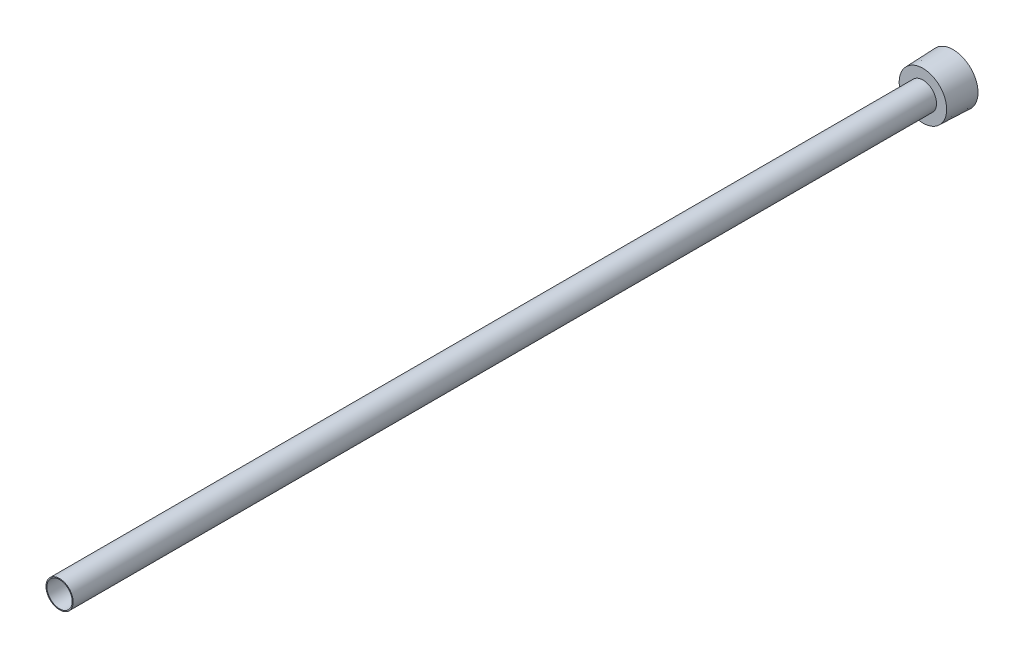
ISO-10303-21;
HEADER;
FILE_DESCRIPTION(('STEP AP214'),'2;1');
FILE_NAME('part.step','',(''),(''),'','','');
FILE_SCHEMA(('AUTOMOTIVE_DESIGN { 1 0 10303 214 1 1 1 1 }'));
ENDSEC;
DATA;
#1=APPLICATION_CONTEXT('core data for automotive mechanical design processes');
#2=APPLICATION_PROTOCOL_DEFINITION('international standard','automotive_design',2000,#1);
#3=PRODUCT_CONTEXT('',#1,'mechanical');
#4=PRODUCT('Part','Part','',(#3));
#5=PRODUCT_RELATED_PRODUCT_CATEGORY('part','',(#4));
#6=PRODUCT_DEFINITION_FORMATION('','',#4);
#7=PRODUCT_DEFINITION_CONTEXT('part definition',#1,'design');
#8=PRODUCT_DEFINITION('design','',#6,#7);
#9=PRODUCT_DEFINITION_SHAPE('','',#8);
#10=(LENGTH_UNIT() NAMED_UNIT(*) SI_UNIT(.MILLI.,.METRE.));
#11=(NAMED_UNIT(*) PLANE_ANGLE_UNIT() SI_UNIT($,.RADIAN.));
#12=(NAMED_UNIT(*) SI_UNIT($,.STERADIAN.) SOLID_ANGLE_UNIT());
#13=UNCERTAINTY_MEASURE_WITH_UNIT(LENGTH_MEASURE(1.E-05),#10,'distance_accuracy_value','');
#14=(GEOMETRIC_REPRESENTATION_CONTEXT(3) GLOBAL_UNCERTAINTY_ASSIGNED_CONTEXT((#13)) GLOBAL_UNIT_ASSIGNED_CONTEXT((#10,
#11,#12)) REPRESENTATION_CONTEXT('',''));
#15=CARTESIAN_POINT('',(0.,0.,0.));
#16=DIRECTION('',(0.,0.,1.));
#17=DIRECTION('',(1.,0.,0.));
#18=AXIS2_PLACEMENT_3D('',#15,#16,#17);
#19=CARTESIAN_POINT('',(0.,0.,0.));
#20=DIRECTION('',(0.,0.,1.));
#21=DIRECTION('',(1.,0.,0.));
#22=AXIS2_PLACEMENT_3D('',#19,#20,#21);
#23=CYLINDRICAL_SURFACE('',#22,4.318);
#24=CARTESIAN_POINT('',(0.,0.,304.8));
#25=DIRECTION('',(0.,0.,1.));
#26=DIRECTION('',(1.,0.,0.));
#27=AXIS2_PLACEMENT_3D('',#24,#25,#26);
#28=CIRCLE('',#27,4.318);
#29=CARTESIAN_POINT('',(4.318,0.,304.8));
#30=VERTEX_POINT('',#29);
#31=EDGE_CURVE('E142',#30,#30,#28,.T.);
#32=CARTESIAN_POINT('',(0.,0.,6.35));
#33=DIRECTION('',(0.,0.,-1.));
#34=DIRECTION('',(-1.,0.,0.));
#35=AXIS2_PLACEMENT_3D('',#32,#33,#34);
#36=CIRCLE('',#35,4.318);
#37=CARTESIAN_POINT('',(4.318,0.,6.35));
#38=VERTEX_POINT('',#37);
#39=EDGE_CURVE('E37',#38,#38,#36,.F.);
#40=CARTESIAN_POINT('',(4.318,0.,304.8));
#41=CARTESIAN_POINT('',(4.318,0.,301.691145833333));
#42=CARTESIAN_POINT('',(4.318,0.,298.582291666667));
#43=CARTESIAN_POINT('',(4.318,0.,292.364583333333));
#44=CARTESIAN_POINT('',(4.318,0.,289.255729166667));
#45=CARTESIAN_POINT('',(4.318,0.,283.038020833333));
#46=CARTESIAN_POINT('',(4.318,0.,279.929166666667));
#47=CARTESIAN_POINT('',(4.318,0.,273.711458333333));
#48=CARTESIAN_POINT('',(4.318,0.,270.602604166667));
#49=CARTESIAN_POINT('',(4.318,0.,264.384895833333));
#50=CARTESIAN_POINT('',(4.318,0.,261.276041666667));
#51=CARTESIAN_POINT('',(4.318,0.,255.058333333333));
#52=CARTESIAN_POINT('',(4.318,0.,251.949479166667));
#53=CARTESIAN_POINT('',(4.318,0.,245.731770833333));
#54=CARTESIAN_POINT('',(4.318,0.,242.622916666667));
#55=CARTESIAN_POINT('',(4.318,0.,236.405208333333));
#56=CARTESIAN_POINT('',(4.318,0.,233.296354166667));
#57=CARTESIAN_POINT('',(4.318,0.,227.078645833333));
#58=CARTESIAN_POINT('',(4.318,0.,223.969791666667));
#59=CARTESIAN_POINT('',(4.318,0.,217.752083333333));
#60=CARTESIAN_POINT('',(4.318,0.,214.643229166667));
#61=CARTESIAN_POINT('',(4.318,0.,208.425520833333));
#62=CARTESIAN_POINT('',(4.318,0.,205.316666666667));
#63=CARTESIAN_POINT('',(4.318,0.,199.098958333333));
#64=CARTESIAN_POINT('',(4.318,0.,195.990104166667));
#65=CARTESIAN_POINT('',(4.318,0.,189.772395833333));
#66=CARTESIAN_POINT('',(4.318,0.,186.663541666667));
#67=CARTESIAN_POINT('',(4.318,0.,180.445833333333));
#68=CARTESIAN_POINT('',(4.318,0.,177.336979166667));
#69=CARTESIAN_POINT('',(4.318,0.,171.119270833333));
#70=CARTESIAN_POINT('',(4.318,0.,168.010416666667));
#71=CARTESIAN_POINT('',(4.318,0.,161.792708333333));
#72=CARTESIAN_POINT('',(4.318,0.,158.683854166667));
#73=CARTESIAN_POINT('',(4.318,0.,152.466145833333));
#74=CARTESIAN_POINT('',(4.318,0.,149.357291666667));
#75=CARTESIAN_POINT('',(4.318,0.,143.139583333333));
#76=CARTESIAN_POINT('',(4.318,0.,140.030729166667));
#77=CARTESIAN_POINT('',(4.318,0.,133.813020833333));
#78=CARTESIAN_POINT('',(4.318,0.,130.704166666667));
#79=CARTESIAN_POINT('',(4.318,0.,124.486458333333));
#80=CARTESIAN_POINT('',(4.318,0.,121.377604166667));
#81=CARTESIAN_POINT('',(4.318,0.,115.159895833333));
#82=CARTESIAN_POINT('',(4.318,0.,112.051041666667));
#83=CARTESIAN_POINT('',(4.318,0.,105.833333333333));
#84=CARTESIAN_POINT('',(4.318,0.,102.724479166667));
#85=CARTESIAN_POINT('',(4.318,0.,96.5067708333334));
#86=CARTESIAN_POINT('',(4.318,0.,93.3979166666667));
#87=CARTESIAN_POINT('',(4.318,0.,87.1802083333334));
#88=CARTESIAN_POINT('',(4.318,0.,84.0713541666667));
#89=CARTESIAN_POINT('',(4.318,0.,77.8536458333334));
#90=CARTESIAN_POINT('',(4.318,0.,74.7447916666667));
#91=CARTESIAN_POINT('',(4.318,0.,68.5270833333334));
#92=CARTESIAN_POINT('',(4.318,0.,65.4182291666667));
#93=CARTESIAN_POINT('',(4.318,0.,59.2005208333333));
#94=CARTESIAN_POINT('',(4.318,0.,56.0916666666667));
#95=CARTESIAN_POINT('',(4.318,0.,49.8739583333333));
#96=CARTESIAN_POINT('',(4.318,0.,46.7651041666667));
#97=CARTESIAN_POINT('',(4.318,0.,40.5473958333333));
#98=CARTESIAN_POINT('',(4.318,0.,37.4385416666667));
#99=CARTESIAN_POINT('',(4.318,0.,31.2208333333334));
#100=CARTESIAN_POINT('',(4.318,0.,28.1119791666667));
#101=CARTESIAN_POINT('',(4.318,0.,21.8942708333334));
#102=CARTESIAN_POINT('',(4.318,0.,18.7854166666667));
#103=CARTESIAN_POINT('',(4.318,0.,12.5677083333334));
#104=CARTESIAN_POINT('',(4.318,0.,9.45885416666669));
#105=CARTESIAN_POINT('',(4.318,0.,6.35000000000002));
#106=B_SPLINE_CURVE_WITH_KNOTS('',3,(#40,#41,#42,#43,#44,#45,#46,#47,#48,#49,#50,#51,#52,#53,
#54,#55,#56,#57,#58,#59,#60,#61,#62,#63,#64,#65,#66,#67,#68,#69,#70,#71,#72,#73,#74,#75,#76,#77,
#78,#79,#80,#81,#82,#83,#84,#85,#86,#87,#88,#89,#90,#91,#92,#93,#94,#95,#96,#97,#98,#99,#100,
#101,#102,#103,#104,#105),.UNSPECIFIED.,.F.,.F.,(4,2,2,2,2,2,2,2,2,2,2,2,2,2,2,2,2,2,2,2,2,2,2,
2,2,2,2,2,2,2,2,2,4),(0.,9.32656250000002,18.653125,27.9796875,37.30625,46.6328125,55.959375,
65.2859375,74.6125,83.9390625,93.265625,102.5921875,111.91875,121.2453125,130.571875,
139.8984375,149.225,158.5515625,167.878125,177.2046875,186.53125,195.8578125,205.184375,
214.5109375,223.8375,233.1640625,242.490625,251.8171875,261.14375,270.4703125,279.796875,
289.1234375,298.45),.UNSPECIFIED.);
#107=EDGE_CURVE('BSEAM33',#30,#38,#106,.T.);
#108=ORIENTED_EDGE('',*,*,#31,.T.);
#109=ORIENTED_EDGE('',*,*,#39,.F.);
#110=ORIENTED_EDGE('',*,*,#107,.T.);
#111=ORIENTED_EDGE('',*,*,#107,.F.);
#112=EDGE_LOOP('',(#108,#110,#109,#111));
#113=FACE_BOUND('',#112,.T.);
#114=ADVANCED_FACE('F33',(#113),#23,.F.);
#115=CARTESIAN_POINT('',(0.,0.,0.));
#116=DIRECTION('',(0.,0.,-1.));
#117=DIRECTION('',(-1.,0.,0.));
#118=AXIS2_PLACEMENT_3D('',#115,#116,#117);
#119=CONICAL_SURFACE('',#118,8.4709,0.0364599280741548);
#120=CARTESIAN_POINT('',(0.,0.,10.3124));
#121=DIRECTION('',(0.,0.,1.));
#122=DIRECTION('',(1.,0.,0.));
#123=AXIS2_PLACEMENT_3D('',#120,#121,#122);
#124=CIRCLE('',#123,8.09474394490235);
#125=CARTESIAN_POINT('',(8.09474394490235,0.,10.3124));
#126=VERTEX_POINT('',#125);
#127=EDGE_CURVE('E11',#126,#126,#124,.T.);
#128=ORIENTED_EDGE('',*,*,#127,.F.);
#129=EDGE_LOOP('',(#128));
#130=FACE_BOUND('',#129,.T.);
#131=CARTESIAN_POINT('',(0.,0.,0.));
#132=DIRECTION('',(0.,0.,1.));
#133=DIRECTION('',(1.,0.,0.));
#134=AXIS2_PLACEMENT_3D('',#131,#132,#133);
#135=CIRCLE('',#134,8.4709);
#136=CARTESIAN_POINT('',(8.4709,0.,0.));
#137=VERTEX_POINT('',#136);
#138=EDGE_CURVE('E145',#137,#137,#135,.T.);
#139=ORIENTED_EDGE('',*,*,#138,.T.);
#140=EDGE_LOOP('',(#139));
#141=FACE_BOUND('',#140,.T.);
#142=ADVANCED_FACE('F35',(#130,#141),#119,.T.);
#143=CARTESIAN_POINT('',(0.,8.09474394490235,10.3124));
#144=DIRECTION('',(0.,0.,-1.));
#145=DIRECTION('',(-1.,0.,0.));
#146=AXIS2_PLACEMENT_3D('',#143,#144,#145);
#147=PLANE('',#146);
#148=CARTESIAN_POINT('',(0.,0.,10.3124));
#149=DIRECTION('',(0.,0.,1.));
#150=DIRECTION('',(1.,0.,0.));
#151=AXIS2_PLACEMENT_3D('',#148,#149,#150);
#152=CIRCLE('',#151,4.6355);
#153=CARTESIAN_POINT('',(4.6355,0.,10.3124));
#154=VERTEX_POINT('',#153);
#155=EDGE_CURVE('E42',#154,#154,#152,.T.);
#156=ORIENTED_EDGE('',*,*,#155,.F.);
#157=EDGE_LOOP('',(#156));
#158=FACE_BOUND('',#157,.T.);
#159=ORIENTED_EDGE('',*,*,#127,.T.);
#160=EDGE_LOOP('',(#159));
#161=FACE_BOUND('',#160,.T.);
#162=ADVANCED_FACE('F156',(#158,#161),#147,.F.);
#163=CARTESIAN_POINT('',(0.,0.,168.793426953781));
#164=DIRECTION('',(0.,0.,1.));
#165=DIRECTION('',(1.,0.,0.));
#166=AXIS2_PLACEMENT_3D('',#163,#164,#165);
#167=CYLINDRICAL_SURFACE('',#166,4.63549999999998);
#168=CARTESIAN_POINT('',(0.,0.,304.8));
#169=DIRECTION('',(0.,0.,1.));
#170=DIRECTION('',(1.,0.,0.));
#171=AXIS2_PLACEMENT_3D('',#168,#169,#170);
#172=CIRCLE('',#171,4.63549999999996);
#173=CARTESIAN_POINT('',(4.63549999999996,0.,304.8));
#174=VERTEX_POINT('',#173);
#175=EDGE_CURVE('E148',#174,#174,#172,.T.);
#176=ORIENTED_EDGE('',*,*,#175,.F.);
#177=EDGE_LOOP('',(#176));
#178=FACE_BOUND('',#177,.T.);
#179=ORIENTED_EDGE('',*,*,#155,.T.);
#180=EDGE_LOOP('',(#179));
#181=FACE_BOUND('',#180,.T.);
#182=ADVANCED_FACE('F154',(#178,#181),#167,.T.);
#183=CARTESIAN_POINT('',(0.,4.63549999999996,304.8));
#184=DIRECTION('',(0.,0.,-1.));
#185=DIRECTION('',(-1.,0.,0.));
#186=AXIS2_PLACEMENT_3D('',#183,#184,#185);
#187=PLANE('',#186);
#188=ORIENTED_EDGE('',*,*,#31,.F.);
#189=EDGE_LOOP('',(#188));
#190=FACE_BOUND('',#189,.T.);
#191=ORIENTED_EDGE('',*,*,#175,.T.);
#192=EDGE_LOOP('',(#191));
#193=FACE_BOUND('',#192,.T.);
#194=ADVANCED_FACE('F167',(#190,#193),#187,.F.);
#195=CARTESIAN_POINT('',(0.,0.,0.));
#196=DIRECTION('',(0.,0.,1.));
#197=DIRECTION('',(1.,0.,0.));
#198=AXIS2_PLACEMENT_3D('',#195,#196,#197);
#199=PLANE('',#198);
#200=DIRECTION('',(-0.866025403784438,0.5,0.));
#201=VECTOR('',#200,1.);
#202=CARTESIAN_POINT('',(0.,-5.49926131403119,0.));
#203=LINE('',#202,#201);
#204=CARTESIAN_POINT('',(0.,-5.49926131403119,0.));
#205=VERTEX_POINT('',#204);
#206=CARTESIAN_POINT('',(-4.7625,-2.74963065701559,0.));
#207=VERTEX_POINT('',#206);
#208=EDGE_CURVE('E124',#205,#207,#203,.T.);
#209=ORIENTED_EDGE('',*,*,#208,.F.);
#210=DIRECTION('',(-0.866025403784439,-0.5,0.));
#211=VECTOR('',#210,1.);
#212=CARTESIAN_POINT('',(4.7625,-2.74963065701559,0.));
#213=LINE('',#212,#211);
#214=CARTESIAN_POINT('',(4.7625,-2.74963065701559,0.));
#215=VERTEX_POINT('',#214);
#216=EDGE_CURVE('E49',#215,#205,#213,.T.);
#217=ORIENTED_EDGE('',*,*,#216,.F.);
#218=DIRECTION('',(0.,-1.,0.));
#219=VECTOR('',#218,1.);
#220=CARTESIAN_POINT('',(4.7625,2.74963065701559,0.));
#221=LINE('',#220,#219);
#222=CARTESIAN_POINT('',(4.7625,2.74963065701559,0.));
#223=VERTEX_POINT('',#222);
#224=EDGE_CURVE('E133',#223,#215,#221,.T.);
#225=ORIENTED_EDGE('',*,*,#224,.F.);
#226=DIRECTION('',(0.866025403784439,-0.5,0.));
#227=VECTOR('',#226,1.);
#228=CARTESIAN_POINT('',(0.,5.49926131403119,0.));
#229=LINE('',#228,#227);
#230=CARTESIAN_POINT('',(0.,5.49926131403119,0.));
#231=VERTEX_POINT('',#230);
#232=EDGE_CURVE('E131',#231,#223,#229,.T.);
#233=ORIENTED_EDGE('',*,*,#232,.F.);
#234=DIRECTION('',(0.866025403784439,0.5,0.));
#235=VECTOR('',#234,1.);
#236=CARTESIAN_POINT('',(-4.7625,2.7496306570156,0.));
#237=LINE('',#236,#235);
#238=CARTESIAN_POINT('',(-4.7625,2.7496306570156,0.));
#239=VERTEX_POINT('',#238);
#240=EDGE_CURVE('E97',#239,#231,#237,.T.);
#241=ORIENTED_EDGE('',*,*,#240,.F.);
#242=DIRECTION('',(0.,1.,0.));
#243=VECTOR('',#242,1.);
#244=CARTESIAN_POINT('',(-4.7625,-2.74963065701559,0.));
#245=LINE('',#244,#243);
#246=EDGE_CURVE('E127',#207,#239,#245,.T.);
#247=ORIENTED_EDGE('',*,*,#246,.F.);
#248=EDGE_LOOP('',(#209,#217,#225,#233,#241,#247));
#249=FACE_BOUND('',#248,.T.);
#250=ORIENTED_EDGE('',*,*,#138,.F.);
#251=EDGE_LOOP('',(#250));
#252=FACE_BOUND('',#251,.T.);
#253=ADVANCED_FACE('F165',(#249,#252),#199,.F.);
#254=CARTESIAN_POINT('',(0.,-5.49926131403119,6.35));
#255=DIRECTION('',(0.,0.,-1.));
#256=DIRECTION('',(-1.,0.,0.));
#257=AXIS2_PLACEMENT_3D('',#254,#255,#256);
#258=PLANE('',#257);
#259=DIRECTION('',(-0.866025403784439,-0.5,0.));
#260=VECTOR('',#259,1.);
#261=CARTESIAN_POINT('',(4.7625,-2.74963065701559,6.35));
#262=LINE('',#261,#260);
#263=CARTESIAN_POINT('',(4.7625,-2.74963065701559,6.35));
#264=VERTEX_POINT('',#263);
#265=CARTESIAN_POINT('',(0.,-5.49926131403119,6.35));
#266=VERTEX_POINT('',#265);
#267=EDGE_CURVE('E135',#264,#266,#262,.T.);
#268=ORIENTED_EDGE('',*,*,#267,.T.);
#269=DIRECTION('',(-0.866025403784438,0.5,0.));
#270=VECTOR('',#269,1.);
#271=CARTESIAN_POINT('',(0.,-5.49926131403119,6.35));
#272=LINE('',#271,#270);
#273=CARTESIAN_POINT('',(-4.7625,-2.74963065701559,6.35));
#274=VERTEX_POINT('',#273);
#275=EDGE_CURVE('E118',#266,#274,#272,.T.);
#276=ORIENTED_EDGE('',*,*,#275,.T.);
#277=DIRECTION('',(0.,1.,0.));
#278=VECTOR('',#277,1.);
#279=CARTESIAN_POINT('',(-4.7625,-2.74963065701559,6.35));
#280=LINE('',#279,#278);
#281=CARTESIAN_POINT('',(-4.7625,2.7496306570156,6.35));
#282=VERTEX_POINT('',#281);
#283=EDGE_CURVE('E116',#274,#282,#280,.T.);
#284=ORIENTED_EDGE('',*,*,#283,.T.);
#285=DIRECTION('',(0.866025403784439,0.5,0.));
#286=VECTOR('',#285,1.);
#287=CARTESIAN_POINT('',(-4.7625,2.7496306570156,6.35));
#288=LINE('',#287,#286);
#289=CARTESIAN_POINT('',(0.,5.49926131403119,6.35));
#290=VERTEX_POINT('',#289);
#291=EDGE_CURVE('E94',#282,#290,#288,.T.);
#292=ORIENTED_EDGE('',*,*,#291,.T.);
#293=DIRECTION('',(0.866025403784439,-0.5,0.));
#294=VECTOR('',#293,1.);
#295=CARTESIAN_POINT('',(0.,5.49926131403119,6.35));
#296=LINE('',#295,#294);
#297=CARTESIAN_POINT('',(4.7625,2.74963065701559,6.35));
#298=VERTEX_POINT('',#297);
#299=EDGE_CURVE('E105',#290,#298,#296,.T.);
#300=ORIENTED_EDGE('',*,*,#299,.T.);
#301=DIRECTION('',(0.,-1.,0.));
#302=VECTOR('',#301,1.);
#303=CARTESIAN_POINT('',(4.7625,2.74963065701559,6.35));
#304=LINE('',#303,#302);
#305=EDGE_CURVE('E109',#298,#264,#304,.T.);
#306=ORIENTED_EDGE('',*,*,#305,.T.);
#307=EDGE_LOOP('',(#268,#276,#284,#292,#300,#306));
#308=FACE_BOUND('',#307,.T.);
#309=ORIENTED_EDGE('',*,*,#39,.T.);
#310=EDGE_LOOP('',(#309));
#311=FACE_BOUND('',#310,.T.);
#312=ADVANCED_FACE('F112',(#308,#311),#258,.T.);
#313=CARTESIAN_POINT('',(4.7625,-2.74963065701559,6.35));
#314=DIRECTION('',(0.5,-0.866025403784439,0.));
#315=DIRECTION('',(0.866025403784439,0.5,0.));
#316=AXIS2_PLACEMENT_3D('',#313,#314,#315);
#317=PLANE('',#316);
#318=ORIENTED_EDGE('',*,*,#216,.T.);
#319=DIRECTION('',(0.,0.,-1.));
#320=VECTOR('',#319,1.);
#321=CARTESIAN_POINT('',(0.,-5.49926131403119,6.35));
#322=LINE('',#321,#320);
#323=EDGE_CURVE('E79',#266,#205,#322,.T.);
#324=ORIENTED_EDGE('',*,*,#323,.F.);
#325=ORIENTED_EDGE('',*,*,#267,.F.);
#326=DIRECTION('',(0.,0.,-1.));
#327=VECTOR('',#326,1.);
#328=CARTESIAN_POINT('',(4.7625,-2.74963065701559,6.35));
#329=LINE('',#328,#327);
#330=EDGE_CURVE('E57',#264,#215,#329,.T.);
#331=ORIENTED_EDGE('',*,*,#330,.T.);
#332=EDGE_LOOP('',(#318,#324,#325,#331));
#333=FACE_BOUND('',#332,.T.);
#334=ADVANCED_FACE('F174',(#333),#317,.F.);
#335=CARTESIAN_POINT('',(4.7625,2.74963065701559,6.35));
#336=DIRECTION('',(1.,0.,0.));
#337=DIRECTION('',(0.,0.,-1.));
#338=AXIS2_PLACEMENT_3D('',#335,#336,#337);
#339=PLANE('',#338);
#340=ORIENTED_EDGE('',*,*,#224,.T.);
#341=ORIENTED_EDGE('',*,*,#330,.F.);
#342=ORIENTED_EDGE('',*,*,#305,.F.);
#343=DIRECTION('',(0.,0.,-1.));
#344=VECTOR('',#343,1.);
#345=CARTESIAN_POINT('',(4.7625,2.74963065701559,6.35));
#346=LINE('',#345,#344);
#347=EDGE_CURVE('E101',#298,#223,#346,.T.);
#348=ORIENTED_EDGE('',*,*,#347,.T.);
#349=EDGE_LOOP('',(#340,#341,#342,#348));
#350=FACE_BOUND('',#349,.T.);
#351=ADVANCED_FACE('F188',(#350),#339,.F.);
#352=CARTESIAN_POINT('',(0.,5.49926131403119,6.35));
#353=DIRECTION('',(0.5,0.866025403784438,0.));
#354=DIRECTION('',(-0.866025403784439,0.5,0.));
#355=AXIS2_PLACEMENT_3D('',#352,#353,#354);
#356=PLANE('',#355);
#357=ORIENTED_EDGE('',*,*,#232,.T.);
#358=ORIENTED_EDGE('',*,*,#347,.F.);
#359=ORIENTED_EDGE('',*,*,#299,.F.);
#360=DIRECTION('',(0.,0.,-1.));
#361=VECTOR('',#360,1.);
#362=CARTESIAN_POINT('',(0.,5.49926131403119,6.35));
#363=LINE('',#362,#361);
#364=EDGE_CURVE('E90',#290,#231,#363,.T.);
#365=ORIENTED_EDGE('',*,*,#364,.T.);
#366=EDGE_LOOP('',(#357,#358,#359,#365));
#367=FACE_BOUND('',#366,.T.);
#368=ADVANCED_FACE('F106',(#367),#356,.F.);
#369=CARTESIAN_POINT('',(-4.7625,2.7496306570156,6.35));
#370=DIRECTION('',(-0.5,0.866025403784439,0.));
#371=DIRECTION('',(-0.866025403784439,-0.5,0.));
#372=AXIS2_PLACEMENT_3D('',#369,#370,#371);
#373=PLANE('',#372);
#374=ORIENTED_EDGE('',*,*,#240,.T.);
#375=ORIENTED_EDGE('',*,*,#364,.F.);
#376=ORIENTED_EDGE('',*,*,#291,.F.);
#377=DIRECTION('',(0.,0.,-1.));
#378=VECTOR('',#377,1.);
#379=CARTESIAN_POINT('',(-4.7625,2.7496306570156,6.35));
#380=LINE('',#379,#378);
#381=EDGE_CURVE('E102',#282,#239,#380,.T.);
#382=ORIENTED_EDGE('',*,*,#381,.T.);
#383=EDGE_LOOP('',(#374,#375,#376,#382));
#384=FACE_BOUND('',#383,.T.);
#385=ADVANCED_FACE('F92',(#384),#373,.F.);
#386=CARTESIAN_POINT('',(-4.7625,-2.74963065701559,6.35));
#387=DIRECTION('',(-1.,0.,0.));
#388=DIRECTION('',(0.,0.,1.));
#389=AXIS2_PLACEMENT_3D('',#386,#387,#388);
#390=PLANE('',#389);
#391=ORIENTED_EDGE('',*,*,#246,.T.);
#392=ORIENTED_EDGE('',*,*,#381,.F.);
#393=ORIENTED_EDGE('',*,*,#283,.F.);
#394=DIRECTION('',(0.,0.,-1.));
#395=VECTOR('',#394,1.);
#396=CARTESIAN_POINT('',(-4.7625,-2.74963065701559,6.35));
#397=LINE('',#396,#395);
#398=EDGE_CURVE('E139',#274,#207,#397,.T.);
#399=ORIENTED_EDGE('',*,*,#398,.T.);
#400=EDGE_LOOP('',(#391,#392,#393,#399));
#401=FACE_BOUND('',#400,.T.);
#402=ADVANCED_FACE('F192',(#401),#390,.F.);
#403=CARTESIAN_POINT('',(0.,-5.49926131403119,6.35));
#404=DIRECTION('',(-0.5,-0.866025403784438,0.));
#405=DIRECTION('',(0.866025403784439,-0.5,0.));
#406=AXIS2_PLACEMENT_3D('',#403,#404,#405);
#407=PLANE('',#406);
#408=ORIENTED_EDGE('',*,*,#208,.T.);
#409=ORIENTED_EDGE('',*,*,#398,.F.);
#410=ORIENTED_EDGE('',*,*,#275,.F.);
#411=ORIENTED_EDGE('',*,*,#323,.T.);
#412=EDGE_LOOP('',(#408,#409,#410,#411));
#413=FACE_BOUND('',#412,.T.);
#414=ADVANCED_FACE('F189',(#413),#407,.F.);
#415=CLOSED_SHELL('',(#114,#142,#162,#182,#194,#253,#312,#334,#351,#368,#385,#402,#414));
#416=MANIFOLD_SOLID_BREP('B2',#415);
#417=ADVANCED_BREP_SHAPE_REPRESENTATION('',(#18,#416),#14);
#418=SHAPE_DEFINITION_REPRESENTATION(#9,#417);
ENDSEC;
END-ISO-10303-21;
